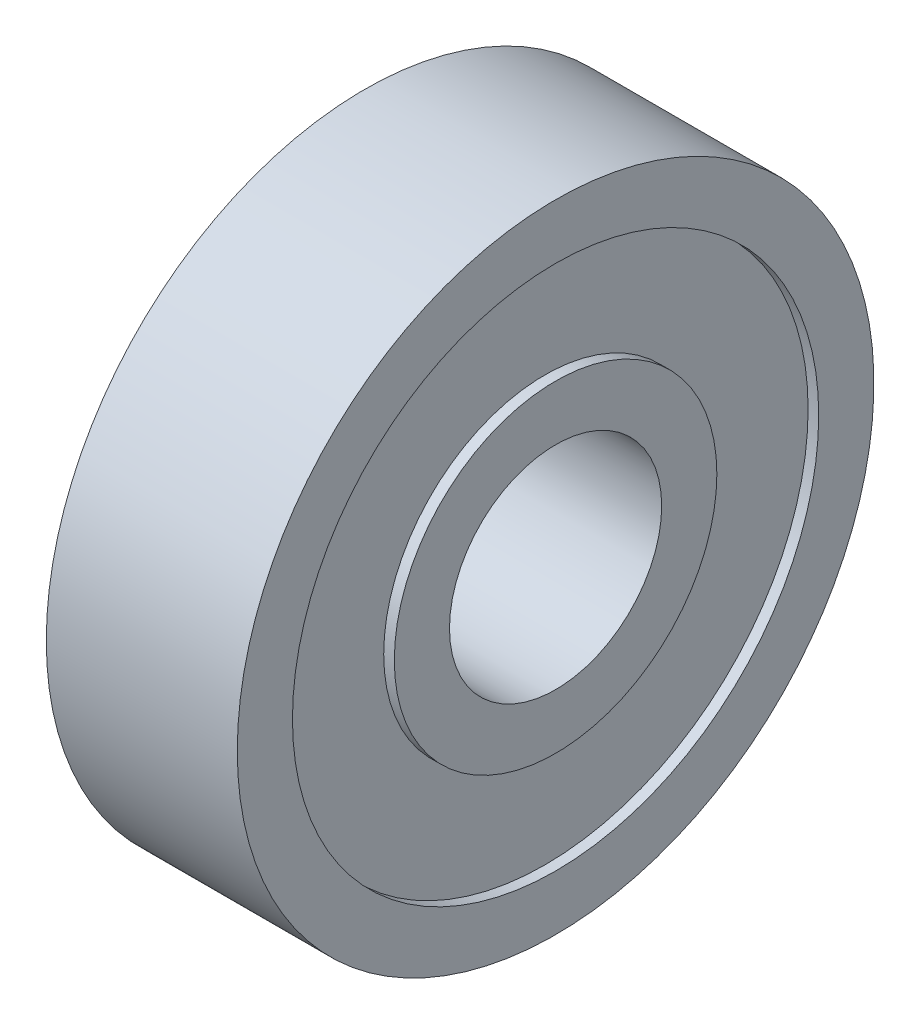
ISO-10303-21;
HEADER;
FILE_DESCRIPTION(('STEP AP214'),'2;1');
FILE_NAME('part.step','',(''),(''),'','','');
FILE_SCHEMA(('AUTOMOTIVE_DESIGN { 1 0 10303 214 1 1 1 1 }'));
ENDSEC;
DATA;
#1=APPLICATION_CONTEXT('core data for automotive mechanical design processes');
#2=APPLICATION_PROTOCOL_DEFINITION('international standard','automotive_design',2000,#1);
#3=PRODUCT_CONTEXT('',#1,'mechanical');
#4=PRODUCT('Part','Part','',(#3));
#5=PRODUCT_RELATED_PRODUCT_CATEGORY('part','',(#4));
#6=PRODUCT_DEFINITION_FORMATION('','',#4);
#7=PRODUCT_DEFINITION_CONTEXT('part definition',#1,'design');
#8=PRODUCT_DEFINITION('design','',#6,#7);
#9=PRODUCT_DEFINITION_SHAPE('','',#8);
#10=(LENGTH_UNIT() NAMED_UNIT(*) SI_UNIT(.MILLI.,.METRE.));
#11=(NAMED_UNIT(*) PLANE_ANGLE_UNIT() SI_UNIT($,.RADIAN.));
#12=(NAMED_UNIT(*) SI_UNIT($,.STERADIAN.) SOLID_ANGLE_UNIT());
#13=UNCERTAINTY_MEASURE_WITH_UNIT(LENGTH_MEASURE(1.E-05),#10,'distance_accuracy_value','');
#14=(GEOMETRIC_REPRESENTATION_CONTEXT(3) GLOBAL_UNCERTAINTY_ASSIGNED_CONTEXT((#13)) GLOBAL_UNIT_ASSIGNED_CONTEXT((#10,
#11,#12)) REPRESENTATION_CONTEXT('',''));
#15=CARTESIAN_POINT('',(0.,0.,0.));
#16=DIRECTION('',(0.,0.,1.));
#17=DIRECTION('',(1.,0.,0.));
#18=AXIS2_PLACEMENT_3D('',#15,#16,#17);
#19=CARTESIAN_POINT('',(7.9,12.8,0.));
#20=DIRECTION('',(1.,0.,0.));
#21=DIRECTION('',(0.,0.,-1.));
#22=AXIS2_PLACEMENT_3D('',#19,#20,#21);
#23=PLANE('',#22);
#24=CARTESIAN_POINT('',(7.9,0.,0.));
#25=DIRECTION('',(-1.,0.,0.));
#26=DIRECTION('',(0.,0.,1.));
#27=AXIS2_PLACEMENT_3D('',#24,#25,#26);
#28=CIRCLE('',#27,7.2);
#29=CARTESIAN_POINT('',(7.9,0.,7.2));
#30=VERTEX_POINT('',#29);
#31=EDGE_CURVE('E11',#30,#30,#28,.T.);
#32=ORIENTED_EDGE('',*,*,#31,.F.);
#33=EDGE_LOOP('',(#32));
#34=FACE_BOUND('',#33,.T.);
#35=CARTESIAN_POINT('',(7.9,0.,0.));
#36=DIRECTION('',(-1.,0.,0.));
#37=DIRECTION('',(0.,0.,1.));
#38=AXIS2_PLACEMENT_3D('',#35,#36,#37);
#39=CIRCLE('',#38,12.8);
#40=CARTESIAN_POINT('',(7.9,0.,12.8));
#41=VERTEX_POINT('',#40);
#42=EDGE_CURVE('E55',#41,#41,#39,.T.);
#43=ORIENTED_EDGE('',*,*,#42,.T.);
#44=EDGE_LOOP('',(#43));
#45=FACE_BOUND('',#44,.T.);
#46=ADVANCED_FACE('F41',(#34,#45),#23,.F.);
#47=CARTESIAN_POINT('',(0.,0.,0.));
#48=DIRECTION('',(-1.,0.,0.));
#49=DIRECTION('',(0.,0.,1.));
#50=AXIS2_PLACEMENT_3D('',#47,#48,#49);
#51=CYLINDRICAL_SURFACE('',#50,7.2);
#52=CARTESIAN_POINT('',(8.4,0.,0.));
#53=DIRECTION('',(-1.,0.,0.));
#54=DIRECTION('',(0.,0.,1.));
#55=AXIS2_PLACEMENT_3D('',#52,#53,#54);
#56=CIRCLE('',#55,7.2);
#57=CARTESIAN_POINT('',(8.4,0.,7.2));
#58=VERTEX_POINT('',#57);
#59=EDGE_CURVE('E47',#58,#58,#56,.T.);
#60=ORIENTED_EDGE('',*,*,#59,.F.);
#61=EDGE_LOOP('',(#60));
#62=FACE_BOUND('',#61,.T.);
#63=ORIENTED_EDGE('',*,*,#31,.T.);
#64=EDGE_LOOP('',(#63));
#65=FACE_BOUND('',#64,.T.);
#66=ADVANCED_FACE('F70',(#62,#65),#51,.F.);
#67=CARTESIAN_POINT('',(8.4,12.8,0.));
#68=DIRECTION('',(-1.,0.,0.));
#69=DIRECTION('',(0.,0.,1.));
#70=AXIS2_PLACEMENT_3D('',#67,#68,#69);
#71=PLANE('',#70);
#72=CARTESIAN_POINT('',(8.4,0.,0.));
#73=DIRECTION('',(-1.,0.,0.));
#74=DIRECTION('',(0.,0.,1.));
#75=AXIS2_PLACEMENT_3D('',#72,#73,#74);
#76=CIRCLE('',#75,12.8);
#77=CARTESIAN_POINT('',(8.4,0.,12.8));
#78=VERTEX_POINT('',#77);
#79=EDGE_CURVE('E51',#78,#78,#76,.T.);
#80=ORIENTED_EDGE('',*,*,#79,.F.);
#81=EDGE_LOOP('',(#80));
#82=FACE_BOUND('',#81,.T.);
#83=ORIENTED_EDGE('',*,*,#59,.T.);
#84=EDGE_LOOP('',(#83));
#85=FACE_BOUND('',#84,.T.);
#86=ADVANCED_FACE('F65',(#82,#85),#71,.F.);
#87=CARTESIAN_POINT('',(0.,0.,0.));
#88=DIRECTION('',(-1.,0.,0.));
#89=DIRECTION('',(0.,0.,1.));
#90=AXIS2_PLACEMENT_3D('',#87,#88,#89);
#91=CYLINDRICAL_SURFACE('',#90,12.8);
#92=ORIENTED_EDGE('',*,*,#42,.F.);
#93=EDGE_LOOP('',(#92));
#94=FACE_BOUND('',#93,.T.);
#95=ORIENTED_EDGE('',*,*,#79,.T.);
#96=EDGE_LOOP('',(#95));
#97=FACE_BOUND('',#96,.T.);
#98=ADVANCED_FACE('F62',(#94,#97),#91,.T.);
#99=CLOSED_SHELL('',(#46,#66,#86,#98));
#100=MANIFOLD_SOLID_BREP('B2',#99);
#101=CARTESIAN_POINT('',(0.6,12.8,0.));
#102=DIRECTION('',(1.,0.,0.));
#103=DIRECTION('',(0.,0.,-1.));
#104=AXIS2_PLACEMENT_3D('',#101,#102,#103);
#105=PLANE('',#104);
#106=CARTESIAN_POINT('',(0.6,0.,0.));
#107=DIRECTION('',(-1.,0.,0.));
#108=DIRECTION('',(0.,0.,1.));
#109=AXIS2_PLACEMENT_3D('',#106,#107,#108);
#110=CIRCLE('',#109,7.2);
#111=CARTESIAN_POINT('',(0.6,0.,7.2));
#112=VERTEX_POINT('',#111);
#113=EDGE_CURVE('E40',#112,#112,#110,.T.);
#114=ORIENTED_EDGE('',*,*,#113,.F.);
#115=EDGE_LOOP('',(#114));
#116=FACE_BOUND('',#115,.T.);
#117=CARTESIAN_POINT('',(0.599999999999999,0.,0.));
#118=DIRECTION('',(-1.,0.,0.));
#119=DIRECTION('',(0.,0.,1.));
#120=AXIS2_PLACEMENT_3D('',#117,#118,#119);
#121=CIRCLE('',#120,12.8);
#122=CARTESIAN_POINT('',(0.599999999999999,0.,12.8));
#123=VERTEX_POINT('',#122);
#124=EDGE_CURVE('E124',#123,#123,#121,.T.);
#125=ORIENTED_EDGE('',*,*,#124,.T.);
#126=EDGE_LOOP('',(#125));
#127=FACE_BOUND('',#126,.T.);
#128=ADVANCED_FACE('F110',(#116,#127),#105,.F.);
#129=CARTESIAN_POINT('',(0.,0.,0.));
#130=DIRECTION('',(-1.,0.,0.));
#131=DIRECTION('',(0.,0.,1.));
#132=AXIS2_PLACEMENT_3D('',#129,#130,#131);
#133=CYLINDRICAL_SURFACE('',#132,7.2);
#134=CARTESIAN_POINT('',(1.1,0.,0.));
#135=DIRECTION('',(-1.,0.,0.));
#136=DIRECTION('',(0.,0.,1.));
#137=AXIS2_PLACEMENT_3D('',#134,#135,#136);
#138=CIRCLE('',#137,7.2);
#139=CARTESIAN_POINT('',(1.1,0.,7.2));
#140=VERTEX_POINT('',#139);
#141=EDGE_CURVE('E116',#140,#140,#138,.T.);
#142=ORIENTED_EDGE('',*,*,#141,.F.);
#143=EDGE_LOOP('',(#142));
#144=FACE_BOUND('',#143,.T.);
#145=ORIENTED_EDGE('',*,*,#113,.T.);
#146=EDGE_LOOP('',(#145));
#147=FACE_BOUND('',#146,.T.);
#148=ADVANCED_FACE('F139',(#144,#147),#133,.F.);
#149=CARTESIAN_POINT('',(1.1,12.8,0.));
#150=DIRECTION('',(-1.,0.,0.));
#151=DIRECTION('',(0.,0.,1.));
#152=AXIS2_PLACEMENT_3D('',#149,#150,#151);
#153=PLANE('',#152);
#154=CARTESIAN_POINT('',(1.1,0.,0.));
#155=DIRECTION('',(-1.,0.,0.));
#156=DIRECTION('',(0.,0.,1.));
#157=AXIS2_PLACEMENT_3D('',#154,#155,#156);
#158=CIRCLE('',#157,12.8);
#159=CARTESIAN_POINT('',(1.1,0.,12.8));
#160=VERTEX_POINT('',#159);
#161=EDGE_CURVE('E120',#160,#160,#158,.T.);
#162=ORIENTED_EDGE('',*,*,#161,.F.);
#163=EDGE_LOOP('',(#162));
#164=FACE_BOUND('',#163,.T.);
#165=ORIENTED_EDGE('',*,*,#141,.T.);
#166=EDGE_LOOP('',(#165));
#167=FACE_BOUND('',#166,.T.);
#168=ADVANCED_FACE('F134',(#164,#167),#153,.F.);
#169=CARTESIAN_POINT('',(0.,0.,0.));
#170=DIRECTION('',(-1.,0.,0.));
#171=DIRECTION('',(0.,0.,1.));
#172=AXIS2_PLACEMENT_3D('',#169,#170,#171);
#173=CYLINDRICAL_SURFACE('',#172,12.8);
#174=ORIENTED_EDGE('',*,*,#124,.F.);
#175=EDGE_LOOP('',(#174));
#176=FACE_BOUND('',#175,.T.);
#177=ORIENTED_EDGE('',*,*,#161,.T.);
#178=EDGE_LOOP('',(#177));
#179=FACE_BOUND('',#178,.T.);
#180=ADVANCED_FACE('F131',(#176,#179),#173,.T.);
#181=CLOSED_SHELL('',(#128,#148,#168,#180));
#182=MANIFOLD_SOLID_BREP('B6',#181);
#183=CARTESIAN_POINT('',(4.5,0.,0.));
#184=DIRECTION('',(-1.,0.,0.));
#185=DIRECTION('',(0.,0.,1.));
#186=AXIS2_PLACEMENT_3D('',#183,#184,#185);
#187=TOROIDAL_SURFACE('',#186,10.,2.9);
#188=CARTESIAN_POINT('',(4.5,0.,12.9));
#189=VERTEX_POINT('',#188);
#190=VERTEX_LOOP('',#189);
#191=FACE_BOUND('',#190,.T.);
#192=ADVANCED_FACE('F181',(#191),#187,.T.);
#193=CLOSED_SHELL('',(#192));
#194=MANIFOLD_SOLID_BREP('B35',#193);
#195=CARTESIAN_POINT('',(0.,7.6,0.));
#196=DIRECTION('',(1.,0.,0.));
#197=DIRECTION('',(0.,0.,-1.));
#198=AXIS2_PLACEMENT_3D('',#195,#196,#197);
#199=PLANE('',#198);
#200=CARTESIAN_POINT('',(0.,0.,0.));
#201=DIRECTION('',(-1.,0.,0.));
#202=DIRECTION('',(0.,0.,1.));
#203=AXIS2_PLACEMENT_3D('',#200,#201,#202);
#204=CIRCLE('',#203,5.);
#205=CARTESIAN_POINT('',(0.,0.,5.));
#206=VERTEX_POINT('',#205);
#207=EDGE_CURVE('E180',#206,#206,#204,.T.);
#208=ORIENTED_EDGE('',*,*,#207,.F.);
#209=EDGE_LOOP('',(#208));
#210=FACE_BOUND('',#209,.T.);
#211=CARTESIAN_POINT('',(0.,0.,0.));
#212=DIRECTION('',(-1.,0.,0.));
#213=DIRECTION('',(0.,0.,1.));
#214=AXIS2_PLACEMENT_3D('',#211,#212,#213);
#215=CIRCLE('',#214,7.6);
#216=CARTESIAN_POINT('',(0.,0.,7.6));
#217=VERTEX_POINT('',#216);
#218=EDGE_CURVE('E246',#217,#217,#215,.T.);
#219=ORIENTED_EDGE('',*,*,#218,.T.);
#220=EDGE_LOOP('',(#219));
#221=FACE_BOUND('',#220,.T.);
#222=ADVANCED_FACE('F200',(#210,#221),#199,.F.);
#223=CARTESIAN_POINT('',(0.,0.,0.));
#224=DIRECTION('',(-1.,0.,0.));
#225=DIRECTION('',(0.,0.,1.));
#226=AXIS2_PLACEMENT_3D('',#223,#224,#225);
#227=CYLINDRICAL_SURFACE('',#226,5.);
#228=CARTESIAN_POINT('',(9.,0.,0.));
#229=DIRECTION('',(-1.,0.,0.));
#230=DIRECTION('',(0.,0.,1.));
#231=AXIS2_PLACEMENT_3D('',#228,#229,#230);
#232=CIRCLE('',#231,5.);
#233=CARTESIAN_POINT('',(9.,0.,5.));
#234=VERTEX_POINT('',#233);
#235=EDGE_CURVE('E206',#234,#234,#232,.T.);
#236=ORIENTED_EDGE('',*,*,#235,.F.);
#237=EDGE_LOOP('',(#236));
#238=FACE_BOUND('',#237,.T.);
#239=ORIENTED_EDGE('',*,*,#207,.T.);
#240=EDGE_LOOP('',(#239));
#241=FACE_BOUND('',#240,.T.);
#242=ADVANCED_FACE('F319',(#238,#241),#227,.F.);
#243=CARTESIAN_POINT('',(9.,7.6,0.));
#244=DIRECTION('',(-1.,0.,0.));
#245=DIRECTION('',(0.,0.,1.));
#246=AXIS2_PLACEMENT_3D('',#243,#244,#245);
#247=PLANE('',#246);
#248=CARTESIAN_POINT('',(9.,0.,0.));
#249=DIRECTION('',(-1.,0.,0.));
#250=DIRECTION('',(0.,0.,1.));
#251=AXIS2_PLACEMENT_3D('',#248,#249,#250);
#252=CIRCLE('',#251,7.6);
#253=CARTESIAN_POINT('',(9.,0.,7.6));
#254=VERTEX_POINT('',#253);
#255=EDGE_CURVE('E210',#254,#254,#252,.T.);
#256=ORIENTED_EDGE('',*,*,#255,.F.);
#257=EDGE_LOOP('',(#256));
#258=FACE_BOUND('',#257,.T.);
#259=ORIENTED_EDGE('',*,*,#235,.T.);
#260=EDGE_LOOP('',(#259));
#261=FACE_BOUND('',#260,.T.);
#262=ADVANCED_FACE('F314',(#258,#261),#247,.F.);
#263=CARTESIAN_POINT('',(0.,0.,0.));
#264=DIRECTION('',(-1.,0.,0.));
#265=DIRECTION('',(0.,0.,1.));
#266=AXIS2_PLACEMENT_3D('',#263,#264,#265);
#267=CYLINDRICAL_SURFACE('',#266,7.6);
#268=CARTESIAN_POINT('',(8.5,0.,0.));
#269=DIRECTION('',(-1.,0.,0.));
#270=DIRECTION('',(0.,0.,1.));
#271=AXIS2_PLACEMENT_3D('',#268,#269,#270);
#272=CIRCLE('',#271,7.6);
#273=CARTESIAN_POINT('',(8.5,0.,7.6));
#274=VERTEX_POINT('',#273);
#275=EDGE_CURVE('E214',#274,#274,#272,.T.);
#276=ORIENTED_EDGE('',*,*,#275,.F.);
#277=EDGE_LOOP('',(#276));
#278=FACE_BOUND('',#277,.T.);
#279=ORIENTED_EDGE('',*,*,#255,.T.);
#280=EDGE_LOOP('',(#279));
#281=FACE_BOUND('',#280,.T.);
#282=ADVANCED_FACE('F308',(#278,#281),#267,.T.);
#283=CARTESIAN_POINT('',(8.5,7.6,0.));
#284=DIRECTION('',(1.,0.,0.));
#285=DIRECTION('',(0.,0.,-1.));
#286=AXIS2_PLACEMENT_3D('',#283,#284,#285);
#287=PLANE('',#286);
#288=CARTESIAN_POINT('',(8.5,0.,0.));
#289=DIRECTION('',(-1.,0.,0.));
#290=DIRECTION('',(0.,0.,1.));
#291=AXIS2_PLACEMENT_3D('',#288,#289,#290);
#292=CIRCLE('',#291,7.1);
#293=CARTESIAN_POINT('',(8.5,0.,7.1));
#294=VERTEX_POINT('',#293);
#295=EDGE_CURVE('E219',#294,#294,#292,.T.);
#296=ORIENTED_EDGE('',*,*,#295,.F.);
#297=EDGE_LOOP('',(#296));
#298=FACE_BOUND('',#297,.T.);
#299=ORIENTED_EDGE('',*,*,#275,.T.);
#300=EDGE_LOOP('',(#299));
#301=FACE_BOUND('',#300,.T.);
#302=ADVANCED_FACE('F302',(#298,#301),#287,.F.);
#303=CARTESIAN_POINT('',(0.,0.,0.));
#304=DIRECTION('',(-1.,0.,0.));
#305=DIRECTION('',(0.,0.,1.));
#306=AXIS2_PLACEMENT_3D('',#303,#304,#305);
#307=CYLINDRICAL_SURFACE('',#306,7.1);
#308=CARTESIAN_POINT('',(7.8,0.,0.));
#309=DIRECTION('',(-1.,0.,0.));
#310=DIRECTION('',(0.,0.,1.));
#311=AXIS2_PLACEMENT_3D('',#308,#309,#310);
#312=CIRCLE('',#311,7.1);
#313=CARTESIAN_POINT('',(7.8,0.,7.1));
#314=VERTEX_POINT('',#313);
#315=EDGE_CURVE('E222',#314,#314,#312,.T.);
#316=ORIENTED_EDGE('',*,*,#315,.F.);
#317=EDGE_LOOP('',(#316));
#318=FACE_BOUND('',#317,.T.);
#319=ORIENTED_EDGE('',*,*,#295,.T.);
#320=EDGE_LOOP('',(#319));
#321=FACE_BOUND('',#320,.T.);
#322=ADVANCED_FACE('F296',(#318,#321),#307,.T.);
#323=CARTESIAN_POINT('',(7.8,7.6,0.));
#324=DIRECTION('',(-1.,0.,0.));
#325=DIRECTION('',(0.,0.,1.));
#326=AXIS2_PLACEMENT_3D('',#323,#324,#325);
#327=PLANE('',#326);
#328=CARTESIAN_POINT('',(7.8,0.,0.));
#329=DIRECTION('',(-1.,0.,0.));
#330=DIRECTION('',(0.,0.,1.));
#331=AXIS2_PLACEMENT_3D('',#328,#329,#330);
#332=CIRCLE('',#331,7.6);
#333=CARTESIAN_POINT('',(7.8,0.,7.6));
#334=VERTEX_POINT('',#333);
#335=EDGE_CURVE('E225',#334,#334,#332,.T.);
#336=ORIENTED_EDGE('',*,*,#335,.F.);
#337=EDGE_LOOP('',(#336));
#338=FACE_BOUND('',#337,.T.);
#339=ORIENTED_EDGE('',*,*,#315,.T.);
#340=EDGE_LOOP('',(#339));
#341=FACE_BOUND('',#340,.T.);
#342=ADVANCED_FACE('F290',(#338,#341),#327,.F.);
#343=CARTESIAN_POINT('',(0.,0.,0.));
#344=DIRECTION('',(-1.,0.,0.));
#345=DIRECTION('',(0.,0.,1.));
#346=AXIS2_PLACEMENT_3D('',#343,#344,#345);
#347=CYLINDRICAL_SURFACE('',#346,7.6);
#348=CARTESIAN_POINT('',(6.3,0.,0.));
#349=DIRECTION('',(-1.,0.,0.));
#350=DIRECTION('',(0.,0.,1.));
#351=AXIS2_PLACEMENT_3D('',#348,#349,#350);
#352=CIRCLE('',#351,7.6);
#353=CARTESIAN_POINT('',(6.3,0.,7.6));
#354=VERTEX_POINT('',#353);
#355=EDGE_CURVE('E228',#354,#354,#352,.T.);
#356=ORIENTED_EDGE('',*,*,#355,.F.);
#357=EDGE_LOOP('',(#356));
#358=FACE_BOUND('',#357,.T.);
#359=ORIENTED_EDGE('',*,*,#335,.T.);
#360=EDGE_LOOP('',(#359));
#361=FACE_BOUND('',#360,.T.);
#362=ADVANCED_FACE('F284',(#358,#361),#347,.T.);
#363=CARTESIAN_POINT('',(4.5,0.,0.));
#364=DIRECTION('',(-1.,0.,0.));
#365=DIRECTION('',(0.,0.,1.));
#366=AXIS2_PLACEMENT_3D('',#363,#364,#365);
#367=TOROIDAL_SURFACE('',#366,10.,3.);
#368=CARTESIAN_POINT('',(2.7,0.,0.));
#369=DIRECTION('',(-1.,0.,0.));
#370=DIRECTION('',(0.,0.,1.));
#371=AXIS2_PLACEMENT_3D('',#368,#369,#370);
#372=CIRCLE('',#371,7.6);
#373=CARTESIAN_POINT('',(2.7,0.,7.6));
#374=VERTEX_POINT('',#373);
#375=EDGE_CURVE('E231',#374,#374,#372,.T.);
#376=ORIENTED_EDGE('',*,*,#375,.F.);
#377=EDGE_LOOP('',(#376));
#378=FACE_BOUND('',#377,.T.);
#379=ORIENTED_EDGE('',*,*,#355,.T.);
#380=EDGE_LOOP('',(#379));
#381=FACE_BOUND('',#380,.T.);
#382=ADVANCED_FACE('F278',(#378,#381),#367,.F.);
#383=CARTESIAN_POINT('',(0.,0.,0.));
#384=DIRECTION('',(-1.,0.,0.));
#385=DIRECTION('',(0.,0.,1.));
#386=AXIS2_PLACEMENT_3D('',#383,#384,#385);
#387=CYLINDRICAL_SURFACE('',#386,7.6);
#388=CARTESIAN_POINT('',(1.2,0.,0.));
#389=DIRECTION('',(-1.,0.,0.));
#390=DIRECTION('',(0.,0.,1.));
#391=AXIS2_PLACEMENT_3D('',#388,#389,#390);
#392=CIRCLE('',#391,7.6);
#393=CARTESIAN_POINT('',(1.2,0.,7.6));
#394=VERTEX_POINT('',#393);
#395=EDGE_CURVE('E234',#394,#394,#392,.T.);
#396=ORIENTED_EDGE('',*,*,#395,.F.);
#397=EDGE_LOOP('',(#396));
#398=FACE_BOUND('',#397,.T.);
#399=ORIENTED_EDGE('',*,*,#375,.T.);
#400=EDGE_LOOP('',(#399));
#401=FACE_BOUND('',#400,.T.);
#402=ADVANCED_FACE('F272',(#398,#401),#387,.T.);
#403=CARTESIAN_POINT('',(1.2,7.6,0.));
#404=DIRECTION('',(1.,0.,0.));
#405=DIRECTION('',(0.,0.,-1.));
#406=AXIS2_PLACEMENT_3D('',#403,#404,#405);
#407=PLANE('',#406);
#408=CARTESIAN_POINT('',(1.2,0.,0.));
#409=DIRECTION('',(-1.,0.,0.));
#410=DIRECTION('',(0.,0.,1.));
#411=AXIS2_PLACEMENT_3D('',#408,#409,#410);
#412=CIRCLE('',#411,7.1);
#413=CARTESIAN_POINT('',(1.2,0.,7.1));
#414=VERTEX_POINT('',#413);
#415=EDGE_CURVE('E237',#414,#414,#412,.T.);
#416=ORIENTED_EDGE('',*,*,#415,.F.);
#417=EDGE_LOOP('',(#416));
#418=FACE_BOUND('',#417,.T.);
#419=ORIENTED_EDGE('',*,*,#395,.T.);
#420=EDGE_LOOP('',(#419));
#421=FACE_BOUND('',#420,.T.);
#422=ADVANCED_FACE('F266',(#418,#421),#407,.F.);
#423=CARTESIAN_POINT('',(0.,0.,0.));
#424=DIRECTION('',(-1.,0.,0.));
#425=DIRECTION('',(0.,0.,1.));
#426=AXIS2_PLACEMENT_3D('',#423,#424,#425);
#427=CYLINDRICAL_SURFACE('',#426,7.1);
#428=CARTESIAN_POINT('',(0.5,0.,0.));
#429=DIRECTION('',(-1.,0.,0.));
#430=DIRECTION('',(0.,0.,1.));
#431=AXIS2_PLACEMENT_3D('',#428,#429,#430);
#432=CIRCLE('',#431,7.1);
#433=CARTESIAN_POINT('',(0.5,0.,7.1));
#434=VERTEX_POINT('',#433);
#435=EDGE_CURVE('E240',#434,#434,#432,.T.);
#436=ORIENTED_EDGE('',*,*,#435,.F.);
#437=EDGE_LOOP('',(#436));
#438=FACE_BOUND('',#437,.T.);
#439=ORIENTED_EDGE('',*,*,#415,.T.);
#440=EDGE_LOOP('',(#439));
#441=FACE_BOUND('',#440,.T.);
#442=ADVANCED_FACE('F260',(#438,#441),#427,.T.);
#443=CARTESIAN_POINT('',(0.5,7.6,0.));
#444=DIRECTION('',(-1.,0.,0.));
#445=DIRECTION('',(0.,0.,1.));
#446=AXIS2_PLACEMENT_3D('',#443,#444,#445);
#447=PLANE('',#446);
#448=CARTESIAN_POINT('',(0.5,0.,0.));
#449=DIRECTION('',(-1.,0.,0.));
#450=DIRECTION('',(0.,0.,1.));
#451=AXIS2_PLACEMENT_3D('',#448,#449,#450);
#452=CIRCLE('',#451,7.6);
#453=CARTESIAN_POINT('',(0.5,0.,7.6));
#454=VERTEX_POINT('',#453);
#455=EDGE_CURVE('E243',#454,#454,#452,.T.);
#456=ORIENTED_EDGE('',*,*,#455,.F.);
#457=EDGE_LOOP('',(#456));
#458=FACE_BOUND('',#457,.T.);
#459=ORIENTED_EDGE('',*,*,#435,.T.);
#460=EDGE_LOOP('',(#459));
#461=FACE_BOUND('',#460,.T.);
#462=ADVANCED_FACE('F254',(#458,#461),#447,.F.);
#463=CARTESIAN_POINT('',(0.,0.,0.));
#464=DIRECTION('',(-1.,0.,0.));
#465=DIRECTION('',(0.,0.,1.));
#466=AXIS2_PLACEMENT_3D('',#463,#464,#465);
#467=CYLINDRICAL_SURFACE('',#466,7.6);
#468=ORIENTED_EDGE('',*,*,#218,.F.);
#469=EDGE_LOOP('',(#468));
#470=FACE_BOUND('',#469,.T.);
#471=ORIENTED_EDGE('',*,*,#455,.T.);
#472=EDGE_LOOP('',(#471));
#473=FACE_BOUND('',#472,.T.);
#474=ADVANCED_FACE('F251',(#470,#473),#467,.T.);
#475=CLOSED_SHELL('',(#222,#242,#262,#282,#302,#322,#342,#362,#382,#402,#422,#442,#462,#474));
#476=MANIFOLD_SOLID_BREP('B106',#475);
#477=CARTESIAN_POINT('',(0.,15.,0.));
#478=DIRECTION('',(1.,0.,0.));
#479=DIRECTION('',(0.,0.,-1.));
#480=AXIS2_PLACEMENT_3D('',#477,#478,#479);
#481=PLANE('',#480);
#482=CARTESIAN_POINT('',(0.,0.,0.));
#483=DIRECTION('',(-1.,0.,0.));
#484=DIRECTION('',(0.,0.,1.));
#485=AXIS2_PLACEMENT_3D('',#482,#483,#484);
#486=CIRCLE('',#485,12.4);
#487=CARTESIAN_POINT('',(0.,0.,12.4));
#488=VERTEX_POINT('',#487);
#489=EDGE_CURVE('E199',#488,#488,#486,.T.);
#490=ORIENTED_EDGE('',*,*,#489,.F.);
#491=EDGE_LOOP('',(#490));
#492=FACE_BOUND('',#491,.T.);
#493=CARTESIAN_POINT('',(0.,0.,0.));
#494=DIRECTION('',(-1.,0.,0.));
#495=DIRECTION('',(0.,0.,1.));
#496=AXIS2_PLACEMENT_3D('',#493,#494,#495);
#497=CIRCLE('',#496,15.);
#498=CARTESIAN_POINT('',(0.,0.,15.));
#499=VERTEX_POINT('',#498);
#500=EDGE_CURVE('E457',#499,#499,#497,.T.);
#501=ORIENTED_EDGE('',*,*,#500,.T.);
#502=EDGE_LOOP('',(#501));
#503=FACE_BOUND('',#502,.T.);
#504=ADVANCED_FACE('F411',(#492,#503),#481,.F.);
#505=CARTESIAN_POINT('',(0.,0.,0.));
#506=DIRECTION('',(-1.,0.,0.));
#507=DIRECTION('',(0.,0.,1.));
#508=AXIS2_PLACEMENT_3D('',#505,#506,#507);
#509=CYLINDRICAL_SURFACE('',#508,12.4);
#510=CARTESIAN_POINT('',(0.499999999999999,0.,0.));
#511=DIRECTION('',(-1.,0.,0.));
#512=DIRECTION('',(0.,0.,1.));
#513=AXIS2_PLACEMENT_3D('',#510,#511,#512);
#514=CIRCLE('',#513,12.4);
#515=CARTESIAN_POINT('',(0.499999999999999,0.,12.4));
#516=VERTEX_POINT('',#515);
#517=EDGE_CURVE('E417',#516,#516,#514,.T.);
#518=ORIENTED_EDGE('',*,*,#517,.F.);
#519=EDGE_LOOP('',(#518));
#520=FACE_BOUND('',#519,.T.);
#521=ORIENTED_EDGE('',*,*,#489,.T.);
#522=EDGE_LOOP('',(#521));
#523=FACE_BOUND('',#522,.T.);
#524=ADVANCED_FACE('F530',(#520,#523),#509,.F.);
#525=CARTESIAN_POINT('',(0.499999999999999,12.9,0.));
#526=DIRECTION('',(-1.,0.,0.));
#527=DIRECTION('',(0.,0.,1.));
#528=AXIS2_PLACEMENT_3D('',#525,#526,#527);
#529=PLANE('',#528);
#530=CARTESIAN_POINT('',(0.499999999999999,0.,0.));
#531=DIRECTION('',(-1.,0.,0.));
#532=DIRECTION('',(0.,0.,1.));
#533=AXIS2_PLACEMENT_3D('',#530,#531,#532);
#534=CIRCLE('',#533,12.9);
#535=CARTESIAN_POINT('',(0.499999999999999,0.,12.9));
#536=VERTEX_POINT('',#535);
#537=EDGE_CURVE('E421',#536,#536,#534,.T.);
#538=ORIENTED_EDGE('',*,*,#537,.F.);
#539=EDGE_LOOP('',(#538));
#540=FACE_BOUND('',#539,.T.);
#541=ORIENTED_EDGE('',*,*,#517,.T.);
#542=EDGE_LOOP('',(#541));
#543=FACE_BOUND('',#542,.T.);
#544=ADVANCED_FACE('F525',(#540,#543),#529,.F.);
#545=CARTESIAN_POINT('',(0.,0.,0.));
#546=DIRECTION('',(-1.,0.,0.));
#547=DIRECTION('',(0.,0.,1.));
#548=AXIS2_PLACEMENT_3D('',#545,#546,#547);
#549=CYLINDRICAL_SURFACE('',#548,12.9);
#550=CARTESIAN_POINT('',(1.2,0.,0.));
#551=DIRECTION('',(-1.,0.,0.));
#552=DIRECTION('',(0.,0.,1.));
#553=AXIS2_PLACEMENT_3D('',#550,#551,#552);
#554=CIRCLE('',#553,12.9);
#555=CARTESIAN_POINT('',(1.2,0.,12.9));
#556=VERTEX_POINT('',#555);
#557=EDGE_CURVE('E425',#556,#556,#554,.T.);
#558=ORIENTED_EDGE('',*,*,#557,.F.);
#559=EDGE_LOOP('',(#558));
#560=FACE_BOUND('',#559,.T.);
#561=ORIENTED_EDGE('',*,*,#537,.T.);
#562=EDGE_LOOP('',(#561));
#563=FACE_BOUND('',#562,.T.);
#564=ADVANCED_FACE('F519',(#560,#563),#549,.F.);
#565=CARTESIAN_POINT('',(1.2,12.9,0.));
#566=DIRECTION('',(1.,0.,0.));
#567=DIRECTION('',(0.,0.,-1.));
#568=AXIS2_PLACEMENT_3D('',#565,#566,#567);
#569=PLANE('',#568);
#570=CARTESIAN_POINT('',(1.2,0.,0.));
#571=DIRECTION('',(-1.,0.,0.));
#572=DIRECTION('',(0.,0.,1.));
#573=AXIS2_PLACEMENT_3D('',#570,#571,#572);
#574=CIRCLE('',#573,12.4);
#575=CARTESIAN_POINT('',(1.2,0.,12.4));
#576=VERTEX_POINT('',#575);
#577=EDGE_CURVE('E430',#576,#576,#574,.T.);
#578=ORIENTED_EDGE('',*,*,#577,.F.);
#579=EDGE_LOOP('',(#578));
#580=FACE_BOUND('',#579,.T.);
#581=ORIENTED_EDGE('',*,*,#557,.T.);
#582=EDGE_LOOP('',(#581));
#583=FACE_BOUND('',#582,.T.);
#584=ADVANCED_FACE('F513',(#580,#583),#569,.F.);
#585=CARTESIAN_POINT('',(0.,0.,0.));
#586=DIRECTION('',(-1.,0.,0.));
#587=DIRECTION('',(0.,0.,1.));
#588=AXIS2_PLACEMENT_3D('',#585,#586,#587);
#589=CYLINDRICAL_SURFACE('',#588,12.4);
#590=CARTESIAN_POINT('',(2.7,0.,0.));
#591=DIRECTION('',(-1.,0.,0.));
#592=DIRECTION('',(0.,0.,1.));
#593=AXIS2_PLACEMENT_3D('',#590,#591,#592);
#594=CIRCLE('',#593,12.4);
#595=CARTESIAN_POINT('',(2.7,0.,12.4));
#596=VERTEX_POINT('',#595);
#597=EDGE_CURVE('E433',#596,#596,#594,.T.);
#598=ORIENTED_EDGE('',*,*,#597,.F.);
#599=EDGE_LOOP('',(#598));
#600=FACE_BOUND('',#599,.T.);
#601=ORIENTED_EDGE('',*,*,#577,.T.);
#602=EDGE_LOOP('',(#601));
#603=FACE_BOUND('',#602,.T.);
#604=ADVANCED_FACE('F507',(#600,#603),#589,.F.);
#605=CARTESIAN_POINT('',(4.5,0.,0.));
#606=DIRECTION('',(-1.,0.,0.));
#607=DIRECTION('',(0.,0.,1.));
#608=AXIS2_PLACEMENT_3D('',#605,#606,#607);
#609=TOROIDAL_SURFACE('',#608,10.,3.);
#610=CARTESIAN_POINT('',(6.3,0.,0.));
#611=DIRECTION('',(-1.,0.,0.));
#612=DIRECTION('',(0.,0.,1.));
#613=AXIS2_PLACEMENT_3D('',#610,#611,#612);
#614=CIRCLE('',#613,12.4);
#615=CARTESIAN_POINT('',(6.3,0.,12.4));
#616=VERTEX_POINT('',#615);
#617=EDGE_CURVE('E436',#616,#616,#614,.T.);
#618=ORIENTED_EDGE('',*,*,#617,.F.);
#619=EDGE_LOOP('',(#618));
#620=FACE_BOUND('',#619,.T.);
#621=ORIENTED_EDGE('',*,*,#597,.T.);
#622=EDGE_LOOP('',(#621));
#623=FACE_BOUND('',#622,.T.);
#624=ADVANCED_FACE('F501',(#620,#623),#609,.F.);
#625=CARTESIAN_POINT('',(0.,0.,0.));
#626=DIRECTION('',(-1.,0.,0.));
#627=DIRECTION('',(0.,0.,1.));
#628=AXIS2_PLACEMENT_3D('',#625,#626,#627);
#629=CYLINDRICAL_SURFACE('',#628,12.4);
#630=CARTESIAN_POINT('',(7.8,0.,0.));
#631=DIRECTION('',(-1.,0.,0.));
#632=DIRECTION('',(0.,0.,1.));
#633=AXIS2_PLACEMENT_3D('',#630,#631,#632);
#634=CIRCLE('',#633,12.4);
#635=CARTESIAN_POINT('',(7.8,0.,12.4));
#636=VERTEX_POINT('',#635);
#637=EDGE_CURVE('E439',#636,#636,#634,.T.);
#638=ORIENTED_EDGE('',*,*,#637,.F.);
#639=EDGE_LOOP('',(#638));
#640=FACE_BOUND('',#639,.T.);
#641=ORIENTED_EDGE('',*,*,#617,.T.);
#642=EDGE_LOOP('',(#641));
#643=FACE_BOUND('',#642,.T.);
#644=ADVANCED_FACE('F495',(#640,#643),#629,.F.);
#645=CARTESIAN_POINT('',(7.8,12.9,0.));
#646=DIRECTION('',(-1.,0.,0.));
#647=DIRECTION('',(0.,0.,1.));
#648=AXIS2_PLACEMENT_3D('',#645,#646,#647);
#649=PLANE('',#648);
#650=CARTESIAN_POINT('',(7.8,0.,0.));
#651=DIRECTION('',(-1.,0.,0.));
#652=DIRECTION('',(0.,0.,1.));
#653=AXIS2_PLACEMENT_3D('',#650,#651,#652);
#654=CIRCLE('',#653,12.9);
#655=CARTESIAN_POINT('',(7.8,0.,12.9));
#656=VERTEX_POINT('',#655);
#657=EDGE_CURVE('E442',#656,#656,#654,.T.);
#658=ORIENTED_EDGE('',*,*,#657,.F.);
#659=EDGE_LOOP('',(#658));
#660=FACE_BOUND('',#659,.T.);
#661=ORIENTED_EDGE('',*,*,#637,.T.);
#662=EDGE_LOOP('',(#661));
#663=FACE_BOUND('',#662,.T.);
#664=ADVANCED_FACE('F489',(#660,#663),#649,.F.);
#665=CARTESIAN_POINT('',(0.,0.,0.));
#666=DIRECTION('',(-1.,0.,0.));
#667=DIRECTION('',(0.,0.,1.));
#668=AXIS2_PLACEMENT_3D('',#665,#666,#667);
#669=CYLINDRICAL_SURFACE('',#668,12.9);
#670=CARTESIAN_POINT('',(8.5,0.,0.));
#671=DIRECTION('',(-1.,0.,0.));
#672=DIRECTION('',(0.,0.,1.));
#673=AXIS2_PLACEMENT_3D('',#670,#671,#672);
#674=CIRCLE('',#673,12.9);
#675=CARTESIAN_POINT('',(8.5,0.,12.9));
#676=VERTEX_POINT('',#675);
#677=EDGE_CURVE('E445',#676,#676,#674,.T.);
#678=ORIENTED_EDGE('',*,*,#677,.F.);
#679=EDGE_LOOP('',(#678));
#680=FACE_BOUND('',#679,.T.);
#681=ORIENTED_EDGE('',*,*,#657,.T.);
#682=EDGE_LOOP('',(#681));
#683=FACE_BOUND('',#682,.T.);
#684=ADVANCED_FACE('F483',(#680,#683),#669,.F.);
#685=CARTESIAN_POINT('',(8.5,12.9,0.));
#686=DIRECTION('',(1.,0.,0.));
#687=DIRECTION('',(0.,0.,-1.));
#688=AXIS2_PLACEMENT_3D('',#685,#686,#687);
#689=PLANE('',#688);
#690=CARTESIAN_POINT('',(8.5,0.,0.));
#691=DIRECTION('',(-1.,0.,0.));
#692=DIRECTION('',(0.,0.,1.));
#693=AXIS2_PLACEMENT_3D('',#690,#691,#692);
#694=CIRCLE('',#693,12.4);
#695=CARTESIAN_POINT('',(8.5,0.,12.4));
#696=VERTEX_POINT('',#695);
#697=EDGE_CURVE('E448',#696,#696,#694,.T.);
#698=ORIENTED_EDGE('',*,*,#697,.F.);
#699=EDGE_LOOP('',(#698));
#700=FACE_BOUND('',#699,.T.);
#701=ORIENTED_EDGE('',*,*,#677,.T.);
#702=EDGE_LOOP('',(#701));
#703=FACE_BOUND('',#702,.T.);
#704=ADVANCED_FACE('F477',(#700,#703),#689,.F.);
#705=CARTESIAN_POINT('',(0.,0.,0.));
#706=DIRECTION('',(-1.,0.,0.));
#707=DIRECTION('',(0.,0.,1.));
#708=AXIS2_PLACEMENT_3D('',#705,#706,#707);
#709=CYLINDRICAL_SURFACE('',#708,12.4);
#710=CARTESIAN_POINT('',(9.,0.,0.));
#711=DIRECTION('',(-1.,0.,0.));
#712=DIRECTION('',(0.,0.,1.));
#713=AXIS2_PLACEMENT_3D('',#710,#711,#712);
#714=CIRCLE('',#713,12.4);
#715=CARTESIAN_POINT('',(9.,0.,12.4));
#716=VERTEX_POINT('',#715);
#717=EDGE_CURVE('E451',#716,#716,#714,.T.);
#718=ORIENTED_EDGE('',*,*,#717,.F.);
#719=EDGE_LOOP('',(#718));
#720=FACE_BOUND('',#719,.T.);
#721=ORIENTED_EDGE('',*,*,#697,.T.);
#722=EDGE_LOOP('',(#721));
#723=FACE_BOUND('',#722,.T.);
#724=ADVANCED_FACE('F471',(#720,#723),#709,.F.);
#725=CARTESIAN_POINT('',(9.,15.,0.));
#726=DIRECTION('',(-1.,0.,0.));
#727=DIRECTION('',(0.,0.,1.));
#728=AXIS2_PLACEMENT_3D('',#725,#726,#727);
#729=PLANE('',#728);
#730=CARTESIAN_POINT('',(9.,0.,0.));
#731=DIRECTION('',(-1.,0.,0.));
#732=DIRECTION('',(0.,0.,1.));
#733=AXIS2_PLACEMENT_3D('',#730,#731,#732);
#734=CIRCLE('',#733,15.);
#735=CARTESIAN_POINT('',(9.,0.,15.));
#736=VERTEX_POINT('',#735);
#737=EDGE_CURVE('E454',#736,#736,#734,.T.);
#738=ORIENTED_EDGE('',*,*,#737,.F.);
#739=EDGE_LOOP('',(#738));
#740=FACE_BOUND('',#739,.T.);
#741=ORIENTED_EDGE('',*,*,#717,.T.);
#742=EDGE_LOOP('',(#741));
#743=FACE_BOUND('',#742,.T.);
#744=ADVANCED_FACE('F465',(#740,#743),#729,.F.);
#745=CARTESIAN_POINT('',(0.,0.,0.));
#746=DIRECTION('',(-1.,0.,0.));
#747=DIRECTION('',(0.,0.,1.));
#748=AXIS2_PLACEMENT_3D('',#745,#746,#747);
#749=CYLINDRICAL_SURFACE('',#748,15.);
#750=ORIENTED_EDGE('',*,*,#500,.F.);
#751=EDGE_LOOP('',(#750));
#752=FACE_BOUND('',#751,.T.);
#753=ORIENTED_EDGE('',*,*,#737,.T.);
#754=EDGE_LOOP('',(#753));
#755=FACE_BOUND('',#754,.T.);
#756=ADVANCED_FACE('F462',(#752,#755),#749,.T.);
#757=CLOSED_SHELL('',(#504,#524,#544,#564,#584,#604,#624,#644,#664,#684,#704,#724,#744,#756));
#758=MANIFOLD_SOLID_BREP('B175',#757);
#759=ADVANCED_BREP_SHAPE_REPRESENTATION('',(#18,#100,#182,#194,#476,#758),#14);
#760=SHAPE_DEFINITION_REPRESENTATION(#9,#759);
ENDSEC;
END-ISO-10303-21;
